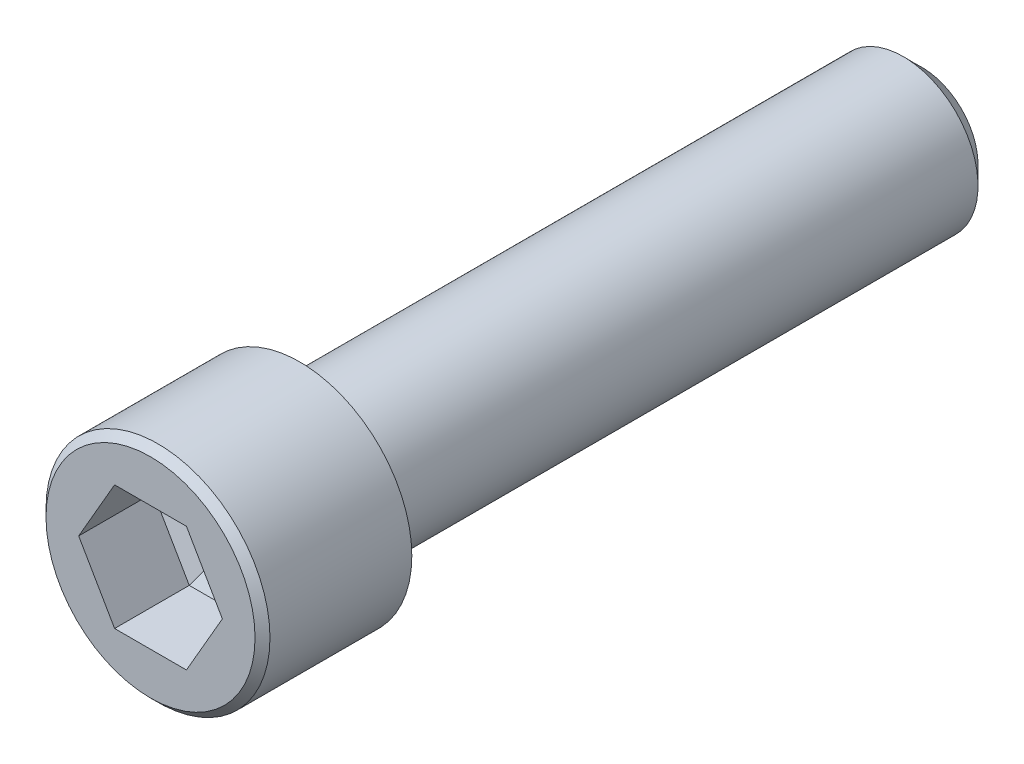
ISO-10303-21;
HEADER;
FILE_DESCRIPTION(('STEP AP214'),'2;1');
FILE_NAME('part.step','',(''),(''),'','','');
FILE_SCHEMA(('AUTOMOTIVE_DESIGN { 1 0 10303 214 1 1 1 1 }'));
ENDSEC;
DATA;
#1=APPLICATION_CONTEXT('core data for automotive mechanical design processes');
#2=APPLICATION_PROTOCOL_DEFINITION('international standard','automotive_design',2000,#1);
#3=PRODUCT_CONTEXT('',#1,'mechanical');
#4=PRODUCT('Part','Part','',(#3));
#5=PRODUCT_RELATED_PRODUCT_CATEGORY('part','',(#4));
#6=PRODUCT_DEFINITION_FORMATION('','',#4);
#7=PRODUCT_DEFINITION_CONTEXT('part definition',#1,'design');
#8=PRODUCT_DEFINITION('design','',#6,#7);
#9=PRODUCT_DEFINITION_SHAPE('','',#8);
#10=(LENGTH_UNIT() NAMED_UNIT(*) SI_UNIT(.MILLI.,.METRE.));
#11=(NAMED_UNIT(*) PLANE_ANGLE_UNIT() SI_UNIT($,.RADIAN.));
#12=(NAMED_UNIT(*) SI_UNIT($,.STERADIAN.) SOLID_ANGLE_UNIT());
#13=UNCERTAINTY_MEASURE_WITH_UNIT(LENGTH_MEASURE(1.E-05),#10,'distance_accuracy_value','');
#14=(GEOMETRIC_REPRESENTATION_CONTEXT(3) GLOBAL_UNCERTAINTY_ASSIGNED_CONTEXT((#13)) GLOBAL_UNIT_ASSIGNED_CONTEXT((#10,
#11,#12)) REPRESENTATION_CONTEXT('',''));
#15=CARTESIAN_POINT('',(0.,0.,0.));
#16=DIRECTION('',(0.,0.,1.));
#17=DIRECTION('',(1.,0.,0.));
#18=AXIS2_PLACEMENT_3D('',#15,#16,#17);
#19=CARTESIAN_POINT('',(-176.5,-7.85000000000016,-22.0000000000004));
#20=DIRECTION('',(0.,0.,-1.));
#21=DIRECTION('',(-1.,0.,0.));
#22=AXIS2_PLACEMENT_3D('',#19,#20,#21);
#23=PLANE('',#22);
#24=CARTESIAN_POINT('',(-176.5,-7.85000000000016,-22.0000000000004));
#25=DIRECTION('',(0.,0.,-1.));
#26=DIRECTION('',(-1.,0.,0.));
#27=AXIS2_PLACEMENT_3D('',#24,#25,#26);
#28=CIRCLE('',#27,3.);
#29=CARTESIAN_POINT('',(-179.5,-7.85000000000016,-22.0000000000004));
#30=VERTEX_POINT('',#29);
#31=EDGE_CURVE('E130',#30,#30,#28,.T.);
#32=ORIENTED_EDGE('',*,*,#31,.F.);
#33=EDGE_LOOP('',(#32));
#34=FACE_BOUND('',#33,.T.);
#35=CARTESIAN_POINT('',(-176.5,-7.85000000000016,-22.0000000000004));
#36=DIRECTION('',(0.,0.,-1.));
#37=DIRECTION('',(-1.,0.,0.));
#38=AXIS2_PLACEMENT_3D('',#35,#36,#37);
#39=CIRCLE('',#38,4.49999999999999);
#40=CARTESIAN_POINT('',(-181.,-7.85000000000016,-22.0000000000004));
#41=VERTEX_POINT('',#40);
#42=EDGE_CURVE('E176',#41,#41,#39,.T.);
#43=ORIENTED_EDGE('',*,*,#42,.T.);
#44=EDGE_LOOP('',(#43));
#45=FACE_BOUND('',#44,.T.);
#46=ADVANCED_FACE('F36',(#34,#45),#23,.T.);
#47=CARTESIAN_POINT('',(-176.5,-7.85000000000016,-62.));
#48=DIRECTION('',(0.,0.,1.));
#49=DIRECTION('',(1.,0.,0.));
#50=AXIS2_PLACEMENT_3D('',#47,#48,#49);
#51=CYLINDRICAL_SURFACE('',#50,3.);
#52=CARTESIAN_POINT('',(-176.5,-7.85000000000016,-46.25));
#53=DIRECTION('',(0.,0.,-1.));
#54=DIRECTION('',(-1.,0.,0.));
#55=AXIS2_PLACEMENT_3D('',#52,#53,#54);
#56=CIRCLE('',#55,3.);
#57=CARTESIAN_POINT('',(-179.5,-7.85000000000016,-46.25));
#58=VERTEX_POINT('',#57);
#59=EDGE_CURVE('E45',#58,#58,#56,.F.);
#60=ORIENTED_EDGE('',*,*,#59,.T.);
#61=EDGE_LOOP('',(#60));
#62=FACE_BOUND('',#61,.T.);
#63=ORIENTED_EDGE('',*,*,#31,.T.);
#64=EDGE_LOOP('',(#63));
#65=FACE_BOUND('',#64,.T.);
#66=ADVANCED_FACE('F135',(#62,#65),#51,.T.);
#67=CARTESIAN_POINT('',(-176.5,-7.85000000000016,-47.));
#68=DIRECTION('',(0.,0.,-1.));
#69=DIRECTION('',(-1.,0.,0.));
#70=AXIS2_PLACEMENT_3D('',#67,#68,#69);
#71=PLANE('',#70);
#72=CARTESIAN_POINT('',(-176.5,-7.85000000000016,-47.));
#73=DIRECTION('',(0.,0.,-1.));
#74=DIRECTION('',(-1.,0.,0.));
#75=AXIS2_PLACEMENT_3D('',#72,#73,#74);
#76=CIRCLE('',#75,2.25);
#77=CARTESIAN_POINT('',(-178.75,-7.85000000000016,-47.));
#78=VERTEX_POINT('',#77);
#79=EDGE_CURVE('E11',#78,#78,#76,.T.);
#80=ORIENTED_EDGE('',*,*,#79,.T.);
#81=EDGE_LOOP('',(#80));
#82=FACE_BOUND('',#81,.T.);
#83=ADVANCED_FACE('F140',(#82),#71,.T.);
#84=CARTESIAN_POINT('',(-176.5,-7.85000000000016,-46.25));
#85=DIRECTION('',(0.,0.,1.));
#86=DIRECTION('',(1.,0.,0.));
#87=AXIS2_PLACEMENT_3D('',#84,#85,#86);
#88=CONICAL_SURFACE('',#87,3.,0.785398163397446);
#89=ORIENTED_EDGE('',*,*,#79,.F.);
#90=EDGE_LOOP('',(#89));
#91=FACE_BOUND('',#90,.T.);
#92=ORIENTED_EDGE('',*,*,#59,.F.);
#93=EDGE_LOOP('',(#92));
#94=FACE_BOUND('',#93,.T.);
#95=ADVANCED_FACE('F38',(#91,#94),#88,.T.);
#96=CARTESIAN_POINT('',(-176.5,-7.85000000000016,-16.0000000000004));
#97=DIRECTION('',(0.,0.,-1.));
#98=DIRECTION('',(-1.,0.,0.));
#99=AXIS2_PLACEMENT_3D('',#96,#97,#98);
#100=CYLINDRICAL_SURFACE('',#99,4.49999999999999);
#101=CARTESIAN_POINT('',(-176.5,-7.85000000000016,-16.3000000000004));
#102=DIRECTION('',(0.,0.,-1.));
#103=DIRECTION('',(-1.,0.,0.));
#104=AXIS2_PLACEMENT_3D('',#101,#102,#103);
#105=CIRCLE('',#104,4.49999999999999);
#106=CARTESIAN_POINT('',(-181.,-7.85000000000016,-16.3000000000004));
#107=VERTEX_POINT('',#106);
#108=EDGE_CURVE('E40',#107,#107,#105,.F.);
#109=ORIENTED_EDGE('',*,*,#108,.F.);
#110=EDGE_LOOP('',(#109));
#111=FACE_BOUND('',#110,.T.);
#112=ORIENTED_EDGE('',*,*,#42,.F.);
#113=EDGE_LOOP('',(#112));
#114=FACE_BOUND('',#113,.T.);
#115=ADVANCED_FACE('F139',(#111,#114),#100,.T.);
#116=CARTESIAN_POINT('',(-177.943375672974,-10.3500000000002,-19.0000000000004));
#117=DIRECTION('',(0.,-0.5,-0.866025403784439));
#118=DIRECTION('',(0.,-0.866025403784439,0.5));
#119=AXIS2_PLACEMENT_3D('',#116,#117,#118);
#120=PLANE('',#119);
#121=DIRECTION('',(1.,0.,0.));
#122=VECTOR('',#121,1.);
#123=CARTESIAN_POINT('',(-177.943375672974,-10.3500000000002,-19.0000000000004));
#124=LINE('',#123,#122);
#125=CARTESIAN_POINT('',(-177.943375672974,-10.3500000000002,-19.0000000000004));
#126=VERTEX_POINT('',#125);
#127=CARTESIAN_POINT('',(-175.056624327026,-10.3500000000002,-19.0000000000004));
#128=VERTEX_POINT('',#127);
#129=EDGE_CURVE('E199',#126,#128,#124,.T.);
#130=ORIENTED_EDGE('',*,*,#129,.T.);
#131=DIRECTION('',(0.447213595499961,-0.774596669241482,0.447213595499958));
#132=VECTOR('',#131,1.);
#133=CARTESIAN_POINT('',(-175.633974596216,-9.35000000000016,-19.5773502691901));
#134=LINE('',#133,#132);
#135=CARTESIAN_POINT('',(-176.5,-7.85000000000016,-20.4433756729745));
#136=VERTEX_POINT('',#135);
#137=EDGE_CURVE('E188',#136,#128,#134,.T.);
#138=ORIENTED_EDGE('',*,*,#137,.F.);
#139=DIRECTION('',(-0.447213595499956,-0.774596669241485,0.447213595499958));
#140=VECTOR('',#139,1.);
#141=CARTESIAN_POINT('',(-177.366025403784,-9.35000000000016,-19.5773502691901));
#142=LINE('',#141,#140);
#143=EDGE_CURVE('E184',#136,#126,#142,.T.);
#144=ORIENTED_EDGE('',*,*,#143,.T.);
#145=EDGE_LOOP('',(#130,#138,#144));
#146=FACE_BOUND('',#145,.T.);
#147=ADVANCED_FACE('F146',(#146),#120,.F.);
#148=CARTESIAN_POINT('',(-175.056624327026,-10.3500000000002,-19.0000000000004));
#149=DIRECTION('',(0.43301270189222,-0.25,-0.866025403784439));
#150=DIRECTION('',(-0.894427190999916,0.,-0.447213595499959));
#151=AXIS2_PLACEMENT_3D('',#148,#149,#150);
#152=PLANE('',#151);
#153=DIRECTION('',(0.5,0.86602540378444,0.));
#154=VECTOR('',#153,1.);
#155=CARTESIAN_POINT('',(-175.056624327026,-10.3500000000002,-19.0000000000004));
#156=LINE('',#155,#154);
#157=CARTESIAN_POINT('',(-173.613248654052,-7.85000000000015,-19.0000000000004));
#158=VERTEX_POINT('',#157);
#159=EDGE_CURVE('E202',#128,#158,#156,.T.);
#160=ORIENTED_EDGE('',*,*,#159,.T.);
#161=DIRECTION('',(0.894427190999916,0.,0.447213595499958));
#162=VECTOR('',#161,1.);
#163=CARTESIAN_POINT('',(-174.767949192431,-7.85000000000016,-19.5773502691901));
#164=LINE('',#163,#162);
#165=EDGE_CURVE('E191',#136,#158,#164,.T.);
#166=ORIENTED_EDGE('',*,*,#165,.F.);
#167=ORIENTED_EDGE('',*,*,#137,.T.);
#168=EDGE_LOOP('',(#160,#166,#167));
#169=FACE_BOUND('',#168,.T.);
#170=ADVANCED_FACE('F243',(#169),#152,.F.);
#171=CARTESIAN_POINT('',(-173.613248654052,-7.85000000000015,-19.0000000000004));
#172=DIRECTION('',(0.433012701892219,0.25,-0.866025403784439));
#173=DIRECTION('',(-0.894427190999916,0.,-0.447213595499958));
#174=AXIS2_PLACEMENT_3D('',#171,#172,#173);
#175=PLANE('',#174);
#176=DIRECTION('',(-0.5,0.866025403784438,0.));
#177=VECTOR('',#176,1.);
#178=CARTESIAN_POINT('',(-173.613248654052,-7.85000000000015,-19.0000000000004));
#179=LINE('',#178,#177);
#180=CARTESIAN_POINT('',(-175.056624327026,-5.35000000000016,-19.0000000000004));
#181=VERTEX_POINT('',#180);
#182=EDGE_CURVE('E91',#158,#181,#179,.T.);
#183=ORIENTED_EDGE('',*,*,#182,.T.);
#184=DIRECTION('',(0.447213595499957,0.774596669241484,0.447213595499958));
#185=VECTOR('',#184,1.);
#186=CARTESIAN_POINT('',(-175.633974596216,-6.35000000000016,-19.5773502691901));
#187=LINE('',#186,#185);
#188=EDGE_CURVE('E194',#136,#181,#187,.T.);
#189=ORIENTED_EDGE('',*,*,#188,.F.);
#190=ORIENTED_EDGE('',*,*,#165,.T.);
#191=EDGE_LOOP('',(#183,#189,#190));
#192=FACE_BOUND('',#191,.T.);
#193=ADVANCED_FACE('F241',(#192),#175,.F.);
#194=CARTESIAN_POINT('',(-175.056624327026,-5.35000000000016,-19.0000000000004));
#195=DIRECTION('',(0.,0.5,-0.866025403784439));
#196=DIRECTION('',(0.,-0.866025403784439,-0.5));
#197=AXIS2_PLACEMENT_3D('',#194,#195,#196);
#198=PLANE('',#197);
#199=DIRECTION('',(-1.,0.,0.));
#200=VECTOR('',#199,1.);
#201=CARTESIAN_POINT('',(-175.056624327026,-5.35000000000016,-19.0000000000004));
#202=LINE('',#201,#200);
#203=CARTESIAN_POINT('',(-177.943375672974,-5.35000000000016,-19.0000000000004));
#204=VERTEX_POINT('',#203);
#205=EDGE_CURVE('E62',#181,#204,#202,.T.);
#206=ORIENTED_EDGE('',*,*,#205,.T.);
#207=DIRECTION('',(-0.447213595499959,0.774596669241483,0.447213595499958));
#208=VECTOR('',#207,1.);
#209=CARTESIAN_POINT('',(-177.366025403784,-6.35000000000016,-19.5773502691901));
#210=LINE('',#209,#208);
#211=EDGE_CURVE('E178',#136,#204,#210,.T.);
#212=ORIENTED_EDGE('',*,*,#211,.F.);
#213=ORIENTED_EDGE('',*,*,#188,.T.);
#214=EDGE_LOOP('',(#206,#212,#213));
#215=FACE_BOUND('',#214,.T.);
#216=ADVANCED_FACE('F238',(#215),#198,.F.);
#217=CARTESIAN_POINT('',(-177.943375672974,-5.35000000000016,-19.0000000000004));
#218=DIRECTION('',(-0.43301270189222,0.25,-0.866025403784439));
#219=DIRECTION('',(-0.894427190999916,0.,0.447213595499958));
#220=AXIS2_PLACEMENT_3D('',#217,#218,#219);
#221=PLANE('',#220);
#222=DIRECTION('',(-0.5,-0.866025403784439,0.));
#223=VECTOR('',#222,1.);
#224=CARTESIAN_POINT('',(-177.943375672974,-5.35000000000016,-19.0000000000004));
#225=LINE('',#224,#223);
#226=CARTESIAN_POINT('',(-179.386751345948,-7.85000000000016,-19.0000000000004));
#227=VERTEX_POINT('',#226);
#228=EDGE_CURVE('E127',#204,#227,#225,.T.);
#229=ORIENTED_EDGE('',*,*,#228,.T.);
#230=DIRECTION('',(-0.894427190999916,0.,0.447213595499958));
#231=VECTOR('',#230,1.);
#232=CARTESIAN_POINT('',(-178.232050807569,-7.85000000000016,-19.5773502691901));
#233=LINE('',#232,#231);
#234=EDGE_CURVE('E175',#136,#227,#233,.T.);
#235=ORIENTED_EDGE('',*,*,#234,.F.);
#236=ORIENTED_EDGE('',*,*,#211,.T.);
#237=EDGE_LOOP('',(#229,#235,#236));
#238=FACE_BOUND('',#237,.T.);
#239=ADVANCED_FACE('F237',(#238),#221,.F.);
#240=CARTESIAN_POINT('',(-179.386751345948,-7.85000000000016,-19.0000000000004));
#241=DIRECTION('',(-0.433012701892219,-0.25,-0.866025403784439));
#242=DIRECTION('',(-0.894427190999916,0.,0.447213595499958));
#243=AXIS2_PLACEMENT_3D('',#240,#241,#242);
#244=PLANE('',#243);
#245=DIRECTION('',(0.5,-0.866025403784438,0.));
#246=VECTOR('',#245,1.);
#247=CARTESIAN_POINT('',(-179.386751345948,-7.85000000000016,-19.0000000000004));
#248=LINE('',#247,#246);
#249=EDGE_CURVE('E117',#227,#126,#248,.T.);
#250=ORIENTED_EDGE('',*,*,#249,.T.);
#251=ORIENTED_EDGE('',*,*,#143,.F.);
#252=ORIENTED_EDGE('',*,*,#234,.T.);
#253=EDGE_LOOP('',(#250,#251,#252));
#254=FACE_BOUND('',#253,.T.);
#255=ADVANCED_FACE('F235',(#254),#244,.F.);
#256=CARTESIAN_POINT('',(-177.943375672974,-10.3500000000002,-19.0000000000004));
#257=DIRECTION('',(0.,-1.,0.));
#258=DIRECTION('',(-1.,0.,0.));
#259=AXIS2_PLACEMENT_3D('',#256,#257,#258);
#260=PLANE('',#259);
#261=DIRECTION('',(1.,0.,0.));
#262=VECTOR('',#261,1.);
#263=CARTESIAN_POINT('',(-177.943375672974,-10.3500000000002,-16.0000000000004));
#264=LINE('',#263,#262);
#265=CARTESIAN_POINT('',(-177.943375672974,-10.3500000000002,-16.0000000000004));
#266=VERTEX_POINT('',#265);
#267=CARTESIAN_POINT('',(-175.056624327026,-10.3500000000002,-16.0000000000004));
#268=VERTEX_POINT('',#267);
#269=EDGE_CURVE('E104',#266,#268,#264,.T.);
#270=ORIENTED_EDGE('',*,*,#269,.T.);
#271=DIRECTION('',(0.,0.,1.));
#272=VECTOR('',#271,1.);
#273=CARTESIAN_POINT('',(-175.056624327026,-10.3500000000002,-19.0000000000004));
#274=LINE('',#273,#272);
#275=EDGE_CURVE('E94',#128,#268,#274,.T.);
#276=ORIENTED_EDGE('',*,*,#275,.F.);
#277=ORIENTED_EDGE('',*,*,#129,.F.);
#278=DIRECTION('',(0.,0.,1.));
#279=VECTOR('',#278,1.);
#280=CARTESIAN_POINT('',(-177.943375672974,-10.3500000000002,-19.0000000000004));
#281=LINE('',#280,#279);
#282=EDGE_CURVE('E123',#126,#266,#281,.T.);
#283=ORIENTED_EDGE('',*,*,#282,.T.);
#284=EDGE_LOOP('',(#270,#276,#277,#283));
#285=FACE_BOUND('',#284,.T.);
#286=ADVANCED_FACE('F211',(#285),#260,.F.);
#287=CARTESIAN_POINT('',(-175.056624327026,-10.3500000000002,-19.0000000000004));
#288=DIRECTION('',(0.86602540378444,-0.5,0.));
#289=DIRECTION('',(-0.5,-0.86602540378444,0.));
#290=AXIS2_PLACEMENT_3D('',#287,#288,#289);
#291=PLANE('',#290);
#292=DIRECTION('',(0.5,0.86602540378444,0.));
#293=VECTOR('',#292,1.);
#294=CARTESIAN_POINT('',(-175.056624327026,-10.3500000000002,-16.0000000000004));
#295=LINE('',#294,#293);
#296=CARTESIAN_POINT('',(-173.613248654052,-7.85000000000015,-16.0000000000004));
#297=VERTEX_POINT('',#296);
#298=EDGE_CURVE('E98',#268,#297,#295,.T.);
#299=ORIENTED_EDGE('',*,*,#298,.T.);
#300=DIRECTION('',(0.,0.,1.));
#301=VECTOR('',#300,1.);
#302=CARTESIAN_POINT('',(-173.613248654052,-7.85000000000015,-19.0000000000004));
#303=LINE('',#302,#301);
#304=EDGE_CURVE('E83',#158,#297,#303,.T.);
#305=ORIENTED_EDGE('',*,*,#304,.F.);
#306=ORIENTED_EDGE('',*,*,#159,.F.);
#307=ORIENTED_EDGE('',*,*,#275,.T.);
#308=EDGE_LOOP('',(#299,#305,#306,#307));
#309=FACE_BOUND('',#308,.T.);
#310=ADVANCED_FACE('F99',(#309),#291,.F.);
#311=CARTESIAN_POINT('',(-173.613248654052,-7.85000000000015,-19.0000000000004));
#312=DIRECTION('',(0.866025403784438,0.5,0.));
#313=DIRECTION('',(0.5,-0.866025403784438,0.));
#314=AXIS2_PLACEMENT_3D('',#311,#312,#313);
#315=PLANE('',#314);
#316=DIRECTION('',(-0.5,0.866025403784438,0.));
#317=VECTOR('',#316,1.);
#318=CARTESIAN_POINT('',(-173.613248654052,-7.85000000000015,-16.0000000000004));
#319=LINE('',#318,#317);
#320=CARTESIAN_POINT('',(-175.056624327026,-5.35000000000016,-16.0000000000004));
#321=VERTEX_POINT('',#320);
#322=EDGE_CURVE('E88',#297,#321,#319,.T.);
#323=ORIENTED_EDGE('',*,*,#322,.T.);
#324=DIRECTION('',(0.,0.,1.));
#325=VECTOR('',#324,1.);
#326=CARTESIAN_POINT('',(-175.056624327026,-5.35000000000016,-19.0000000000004));
#327=LINE('',#326,#325);
#328=EDGE_CURVE('E95',#181,#321,#327,.T.);
#329=ORIENTED_EDGE('',*,*,#328,.F.);
#330=ORIENTED_EDGE('',*,*,#182,.F.);
#331=ORIENTED_EDGE('',*,*,#304,.T.);
#332=EDGE_LOOP('',(#323,#329,#330,#331));
#333=FACE_BOUND('',#332,.T.);
#334=ADVANCED_FACE('F85',(#333),#315,.F.);
#335=CARTESIAN_POINT('',(-175.056624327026,-5.35000000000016,-19.0000000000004));
#336=DIRECTION('',(0.,1.,0.));
#337=DIRECTION('',(1.,0.,0.));
#338=AXIS2_PLACEMENT_3D('',#335,#336,#337);
#339=PLANE('',#338);
#340=DIRECTION('',(-1.,0.,0.));
#341=VECTOR('',#340,1.);
#342=CARTESIAN_POINT('',(-175.056624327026,-5.35000000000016,-16.0000000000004));
#343=LINE('',#342,#341);
#344=CARTESIAN_POINT('',(-177.943375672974,-5.35000000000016,-16.0000000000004));
#345=VERTEX_POINT('',#344);
#346=EDGE_CURVE('E53',#321,#345,#343,.T.);
#347=ORIENTED_EDGE('',*,*,#346,.T.);
#348=DIRECTION('',(0.,0.,1.));
#349=VECTOR('',#348,1.);
#350=CARTESIAN_POINT('',(-177.943375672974,-5.35000000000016,-19.0000000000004));
#351=LINE('',#350,#349);
#352=EDGE_CURVE('E118',#204,#345,#351,.T.);
#353=ORIENTED_EDGE('',*,*,#352,.F.);
#354=ORIENTED_EDGE('',*,*,#205,.F.);
#355=ORIENTED_EDGE('',*,*,#328,.T.);
#356=EDGE_LOOP('',(#347,#353,#354,#355));
#357=FACE_BOUND('',#356,.T.);
#358=ADVANCED_FACE('F223',(#357),#339,.F.);
#359=CARTESIAN_POINT('',(-177.943375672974,-5.35000000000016,-19.0000000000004));
#360=DIRECTION('',(-0.866025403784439,0.5,0.));
#361=DIRECTION('',(0.5,0.866025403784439,0.));
#362=AXIS2_PLACEMENT_3D('',#359,#360,#361);
#363=PLANE('',#362);
#364=DIRECTION('',(-0.5,-0.866025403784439,0.));
#365=VECTOR('',#364,1.);
#366=CARTESIAN_POINT('',(-177.943375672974,-5.35000000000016,-16.0000000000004));
#367=LINE('',#366,#365);
#368=CARTESIAN_POINT('',(-179.386751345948,-7.85000000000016,-16.0000000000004));
#369=VERTEX_POINT('',#368);
#370=EDGE_CURVE('E111',#345,#369,#367,.T.);
#371=ORIENTED_EDGE('',*,*,#370,.T.);
#372=DIRECTION('',(0.,0.,1.));
#373=VECTOR('',#372,1.);
#374=CARTESIAN_POINT('',(-179.386751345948,-7.85000000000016,-19.0000000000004));
#375=LINE('',#374,#373);
#376=EDGE_CURVE('E120',#227,#369,#375,.T.);
#377=ORIENTED_EDGE('',*,*,#376,.F.);
#378=ORIENTED_EDGE('',*,*,#228,.F.);
#379=ORIENTED_EDGE('',*,*,#352,.T.);
#380=EDGE_LOOP('',(#371,#377,#378,#379));
#381=FACE_BOUND('',#380,.T.);
#382=ADVANCED_FACE('F222',(#381),#363,.F.);
#383=CARTESIAN_POINT('',(-179.386751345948,-7.85000000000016,-19.0000000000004));
#384=DIRECTION('',(-0.866025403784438,-0.5,0.));
#385=DIRECTION('',(-0.5,0.866025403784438,0.));
#386=AXIS2_PLACEMENT_3D('',#383,#384,#385);
#387=PLANE('',#386);
#388=DIRECTION('',(0.5,-0.866025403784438,0.));
#389=VECTOR('',#388,1.);
#390=CARTESIAN_POINT('',(-179.386751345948,-7.85000000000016,-16.0000000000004));
#391=LINE('',#390,#389);
#392=EDGE_CURVE('E187',#369,#266,#391,.T.);
#393=ORIENTED_EDGE('',*,*,#392,.T.);
#394=ORIENTED_EDGE('',*,*,#282,.F.);
#395=ORIENTED_EDGE('',*,*,#249,.F.);
#396=ORIENTED_EDGE('',*,*,#376,.T.);
#397=EDGE_LOOP('',(#393,#394,#395,#396));
#398=FACE_BOUND('',#397,.T.);
#399=ADVANCED_FACE('F162',(#398),#387,.F.);
#400=CARTESIAN_POINT('',(-176.5,-7.85000000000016,-16.0000000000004));
#401=DIRECTION('',(0.,0.,1.));
#402=DIRECTION('',(1.,0.,0.));
#403=AXIS2_PLACEMENT_3D('',#400,#401,#402);
#404=PLANE('',#403);
#405=ORIENTED_EDGE('',*,*,#392,.F.);
#406=ORIENTED_EDGE('',*,*,#370,.F.);
#407=ORIENTED_EDGE('',*,*,#346,.F.);
#408=ORIENTED_EDGE('',*,*,#322,.F.);
#409=ORIENTED_EDGE('',*,*,#298,.F.);
#410=ORIENTED_EDGE('',*,*,#269,.F.);
#411=EDGE_LOOP('',(#405,#406,#407,#408,#409,#410));
#412=FACE_BOUND('',#411,.T.);
#413=CARTESIAN_POINT('',(-176.5,-7.85000000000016,-16.0000000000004));
#414=DIRECTION('',(0.,0.,1.));
#415=DIRECTION('',(1.,0.,0.));
#416=AXIS2_PLACEMENT_3D('',#413,#414,#415);
#417=CIRCLE('',#416,4.2);
#418=CARTESIAN_POINT('',(-172.3,-7.85000000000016,-16.0000000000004));
#419=VERTEX_POINT('',#418);
#420=EDGE_CURVE('E125',#419,#419,#417,.T.);
#421=ORIENTED_EDGE('',*,*,#420,.T.);
#422=EDGE_LOOP('',(#421));
#423=FACE_BOUND('',#422,.T.);
#424=ADVANCED_FACE('F107',(#412,#423),#404,.T.);
#425=CARTESIAN_POINT('',(-176.5,-7.85000000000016,-16.8000000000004));
#426=DIRECTION('',(0.,0.,-1.));
#427=DIRECTION('',(-1.,0.,0.));
#428=AXIS2_PLACEMENT_3D('',#425,#426,#427);
#429=CONICAL_SURFACE('',#428,5.,0.785398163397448);
#430=ORIENTED_EDGE('',*,*,#420,.F.);
#431=EDGE_LOOP('',(#430));
#432=FACE_BOUND('',#431,.T.);
#433=ORIENTED_EDGE('',*,*,#108,.T.);
#434=EDGE_LOOP('',(#433));
#435=FACE_BOUND('',#434,.T.);
#436=ADVANCED_FACE('F166',(#432,#435),#429,.T.);
#437=CLOSED_SHELL('',(#46,#66,#83,#95,#115,#147,#170,#193,#216,#239,#255,#286,#310,#334,#358,
#382,#399,#424,#436));
#438=MANIFOLD_SOLID_BREP('B2',#437);
#439=ADVANCED_BREP_SHAPE_REPRESENTATION('',(#18,#438),#14);
#440=SHAPE_DEFINITION_REPRESENTATION(#9,#439);
ENDSEC;
END-ISO-10303-21;
